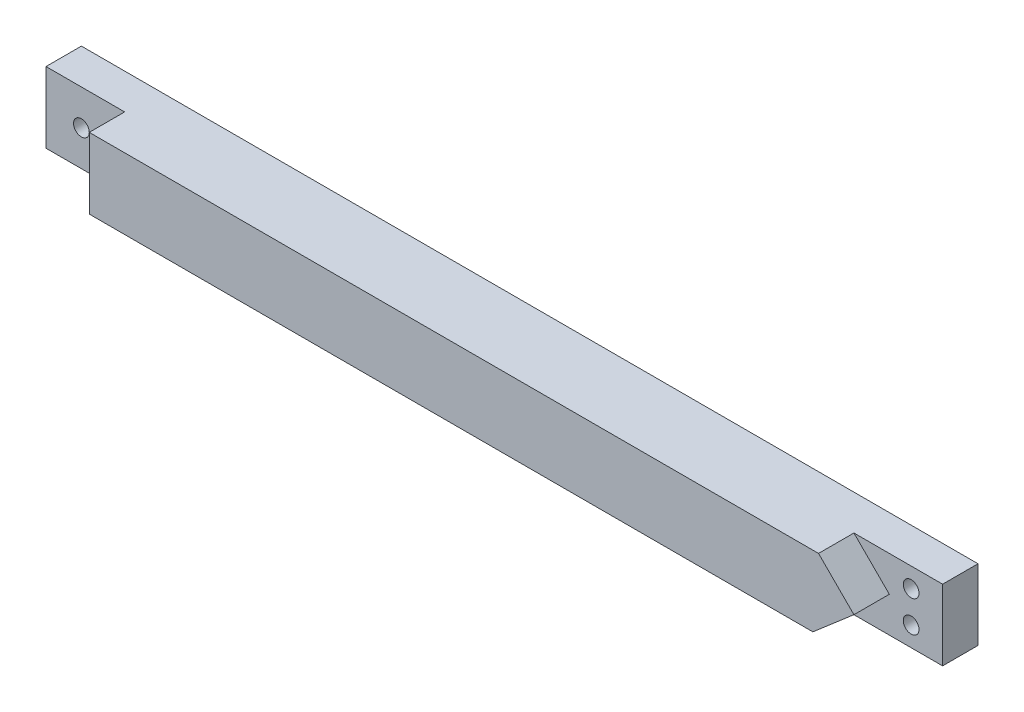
from build123d import *

# Parameters (mm, degrees)
ESQUISSE1_W             = 114
ESQUISSE1_H             = 9
EXTRUSION1_DEPTH        = 9
ESQUISSE2_W             = 10
ESQUISSE2_H             = 9
ENL_V_MAT_EXTRU_1_DEPTH = 4.5
ESQUISSE3_R             = 1
ENL_V_MAT_EXTRU_2_DEPTH = 4.5
ENL_V_MAT_EXTRU_3_DEPTH = 4.5
ESQUISSE5_R             = 1
ENL_V_MAT_EXTRU_4_DEPTH = 4.5


with BuildPart() as part:
    # Esquisse1 → Extrusion1 (new body)
    with BuildSketch(Plane.XY):
        with Locations((57, 4.5)):
            Rectangle(ESQUISSE1_W, ESQUISSE1_H)
    extrude(amount=EXTRUSION1_DEPTH)

    # Esquisse2 → Enl_v. mat.-Extru.1 (cut)
    with BuildSketch(Plane.XY.offset(9)):
        with Locations((5, 4.5)):
            Rectangle(ESQUISSE2_W, ESQUISSE2_H)
    extrude(amount=-ENL_V_MAT_EXTRU_1_DEPTH, mode=Mode.SUBTRACT)

    # Esquisse3 → Enl_v. mat.-Extru.2 (cut)
    with BuildSketch(Plane.XY.offset(4.5)):
        with Locations((4.5, 4.5)):
            Circle(ESQUISSE3_R)
    extrude(amount=-ENL_V_MAT_EXTRU_2_DEPTH, mode=Mode.SUBTRACT)

    # Esquisse4 → Enl_v. mat.-Extru.3 (cut)
    with BuildSketch(Plane.XY.offset(9)):
        Polygon((114, 9), (102.724684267, 9), (107.224684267, 4.5), (102, 0), (114, 0), align=None)
    extrude(amount=-ENL_V_MAT_EXTRU_3_DEPTH, mode=Mode.SUBTRACT)

    # Esquisse5 → Enl_v. mat.-Extru.4 (cut)
    with BuildSketch(Plane.XY.offset(4.5)):
        with Locations((110, 6.5)):
            Circle(ESQUISSE5_R)
        with Locations((110, 2.5)):
            Circle(ESQUISSE5_R)
    extrude(amount=-ENL_V_MAT_EXTRU_4_DEPTH, mode=Mode.SUBTRACT)


solid = part.part
